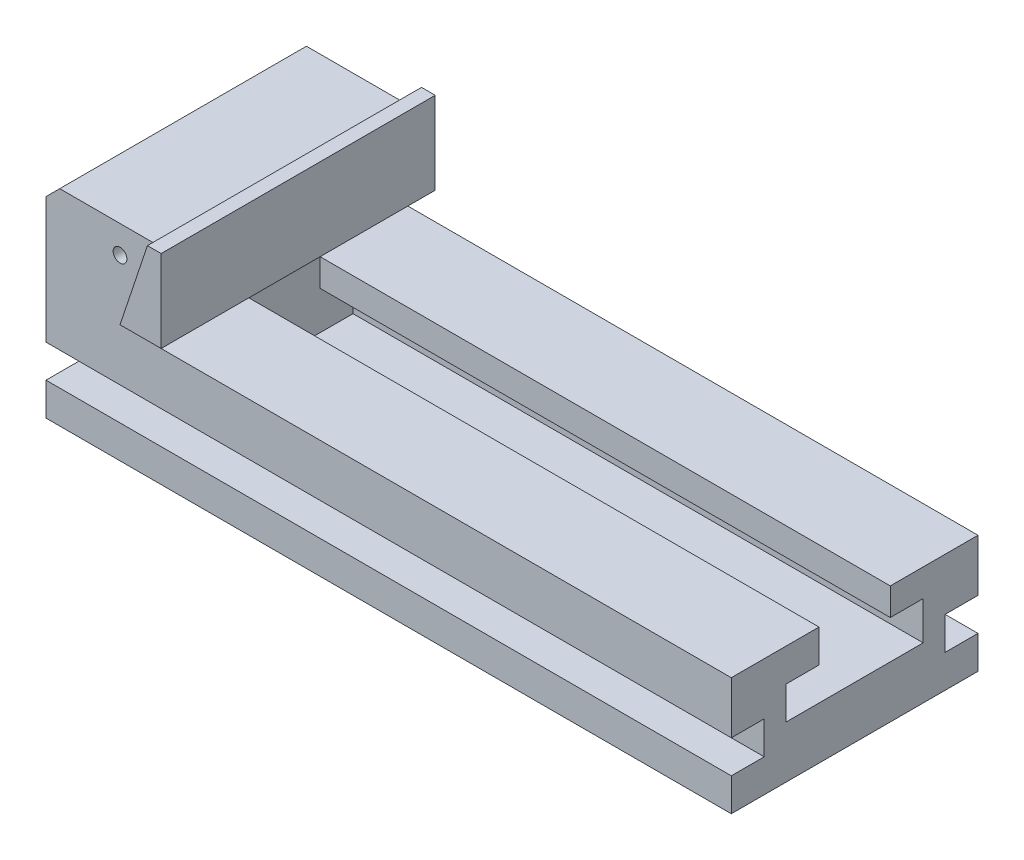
ISO-10303-21;
HEADER;
FILE_DESCRIPTION(('STEP AP214'),'2;1');
FILE_NAME('part.step','',(''),(''),'','','');
FILE_SCHEMA(('AUTOMOTIVE_DESIGN { 1 0 10303 214 1 1 1 1 }'));
ENDSEC;
DATA;
#1=APPLICATION_CONTEXT('core data for automotive mechanical design processes');
#2=APPLICATION_PROTOCOL_DEFINITION('international standard','automotive_design',2000,#1);
#3=PRODUCT_CONTEXT('',#1,'mechanical');
#4=PRODUCT('Part','Part','',(#3));
#5=PRODUCT_RELATED_PRODUCT_CATEGORY('part','',(#4));
#6=PRODUCT_DEFINITION_FORMATION('','',#4);
#7=PRODUCT_DEFINITION_CONTEXT('part definition',#1,'design');
#8=PRODUCT_DEFINITION('design','',#6,#7);
#9=PRODUCT_DEFINITION_SHAPE('','',#8);
#10=(LENGTH_UNIT() NAMED_UNIT(*) SI_UNIT(.MILLI.,.METRE.));
#11=(NAMED_UNIT(*) PLANE_ANGLE_UNIT() SI_UNIT($,.RADIAN.));
#12=(NAMED_UNIT(*) SI_UNIT($,.STERADIAN.) SOLID_ANGLE_UNIT());
#13=UNCERTAINTY_MEASURE_WITH_UNIT(LENGTH_MEASURE(1.E-05),#10,'distance_accuracy_value','');
#14=(GEOMETRIC_REPRESENTATION_CONTEXT(3) GLOBAL_UNCERTAINTY_ASSIGNED_CONTEXT((#13)) GLOBAL_UNIT_ASSIGNED_CONTEXT((#10,
#11,#12)) REPRESENTATION_CONTEXT('',''));
#15=CARTESIAN_POINT('',(0.,0.,0.));
#16=DIRECTION('',(0.,0.,1.));
#17=DIRECTION('',(1.,0.,0.));
#18=AXIS2_PLACEMENT_3D('',#15,#16,#17);
#19=CARTESIAN_POINT('',(0.,75.,0.));
#20=DIRECTION('',(0.,0.,1.));
#21=DIRECTION('',(1.,0.,0.));
#22=AXIS2_PLACEMENT_3D('',#19,#20,#21);
#23=PLANE('',#22);
#24=DIRECTION('',(0.316227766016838,0.948683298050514,0.));
#25=VECTOR('',#24,1.);
#26=CARTESIAN_POINT('',(-188.1,137.7,0.));
#27=LINE('',#26,#25);
#28=CARTESIAN_POINT('',(-218.,48.,0.));
#29=VERTEX_POINT('',#28);
#30=CARTESIAN_POINT('',(-209.,75.,0.));
#31=VERTEX_POINT('',#30);
#32=EDGE_CURVE('E45',#29,#31,#27,.T.);
#33=ORIENTED_EDGE('',*,*,#32,.F.);
#34=DIRECTION('',(-1.,0.,0.));
#35=VECTOR('',#34,1.);
#36=CARTESIAN_POINT('',(0.,48.,0.));
#37=LINE('',#36,#35);
#38=CARTESIAN_POINT('',(-208.,48.,0.));
#39=VERTEX_POINT('',#38);
#40=EDGE_CURVE('E272',#39,#29,#37,.T.);
#41=ORIENTED_EDGE('',*,*,#40,.F.);
#42=DIRECTION('',(0.,1.,0.));
#43=VECTOR('',#42,1.);
#44=CARTESIAN_POINT('',(-208.,48.,0.));
#45=LINE('',#44,#43);
#46=CARTESIAN_POINT('',(-208.,43.,0.));
#47=VERTEX_POINT('',#46);
#48=EDGE_CURVE('E391',#47,#39,#45,.T.);
#49=ORIENTED_EDGE('',*,*,#48,.F.);
#50=DIRECTION('',(-1.,0.,0.));
#51=VECTOR('',#50,1.);
#52=CARTESIAN_POINT('',(-208.,43.,0.));
#53=LINE('',#52,#51);
#54=CARTESIAN_POINT('',(0.,43.,0.));
#55=VERTEX_POINT('',#54);
#56=EDGE_CURVE('E388',#55,#47,#53,.T.);
#57=ORIENTED_EDGE('',*,*,#56,.F.);
#58=DIRECTION('',(0.,1.,0.));
#59=VECTOR('',#58,1.);
#60=CARTESIAN_POINT('',(0.,43.,0.));
#61=LINE('',#60,#59);
#62=CARTESIAN_POINT('',(0.,24.,0.));
#63=VERTEX_POINT('',#62);
#64=EDGE_CURVE('E384',#63,#55,#61,.T.);
#65=ORIENTED_EDGE('',*,*,#64,.F.);
#66=DIRECTION('',(1.,0.,0.));
#67=VECTOR('',#66,1.);
#68=CARTESIAN_POINT('',(-250.,24.,0.));
#69=LINE('',#68,#67);
#70=CARTESIAN_POINT('',(-250.,24.,0.));
#71=VERTEX_POINT('',#70);
#72=EDGE_CURVE('E298',#71,#63,#69,.T.);
#73=ORIENTED_EDGE('',*,*,#72,.F.);
#74=DIRECTION('',(0.,-1.,0.));
#75=VECTOR('',#74,1.);
#76=CARTESIAN_POINT('',(-250.,0.,0.));
#77=LINE('',#76,#75);
#78=CARTESIAN_POINT('',(-250.,69.9999999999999,0.));
#79=VERTEX_POINT('',#78);
#80=EDGE_CURVE('E397',#79,#71,#77,.T.);
#81=ORIENTED_EDGE('',*,*,#80,.F.);
#82=DIRECTION('',(-0.707106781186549,-0.707106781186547,0.));
#83=VECTOR('',#82,1.);
#84=CARTESIAN_POINT('',(-250.,70.,0.));
#85=LINE('',#84,#83);
#86=CARTESIAN_POINT('',(-245.,75.,0.));
#87=VERTEX_POINT('',#86);
#88=EDGE_CURVE('E440',#79,#87,#85,.F.);
#89=ORIENTED_EDGE('',*,*,#88,.T.);
#90=DIRECTION('',(-1.,0.,0.));
#91=VECTOR('',#90,1.);
#92=CARTESIAN_POINT('',(-250.,75.,0.));
#93=LINE('',#92,#91);
#94=EDGE_CURVE('E394',#31,#87,#93,.T.);
#95=ORIENTED_EDGE('',*,*,#94,.F.);
#96=EDGE_LOOP('',(#33,#41,#49,#57,#65,#73,#81,#89,#95));
#97=FACE_BOUND('',#96,.T.);
#98=ADVANCED_FACE('F30',(#97),#23,.F.);
#99=CARTESIAN_POINT('',(-250.,75.,90.));
#100=DIRECTION('',(0.,-1.,0.));
#101=DIRECTION('',(0.,0.,-1.));
#102=AXIS2_PLACEMENT_3D('',#99,#100,#101);
#103=PLANE('',#102);
#104=DIRECTION('',(0.,0.,1.));
#105=VECTOR('',#104,1.);
#106=CARTESIAN_POINT('',(-209.,75.,90.));
#107=LINE('',#106,#105);
#108=CARTESIAN_POINT('',(-209.,75.,90.));
#109=VERTEX_POINT('',#108);
#110=EDGE_CURVE('E53',#31,#109,#107,.T.);
#111=ORIENTED_EDGE('',*,*,#110,.F.);
#112=ORIENTED_EDGE('',*,*,#94,.T.);
#113=DIRECTION('',(0.,0.,1.));
#114=VECTOR('',#113,1.);
#115=CARTESIAN_POINT('',(-245.,75.,90.));
#116=LINE('',#115,#114);
#117=CARTESIAN_POINT('',(-245.,75.,90.));
#118=VERTEX_POINT('',#117);
#119=EDGE_CURVE('E443',#87,#118,#116,.T.);
#120=ORIENTED_EDGE('',*,*,#119,.T.);
#121=DIRECTION('',(-1.,0.,0.));
#122=VECTOR('',#121,1.);
#123=CARTESIAN_POINT('',(-250.,75.,90.));
#124=LINE('',#123,#122);
#125=EDGE_CURVE('E410',#109,#118,#124,.T.);
#126=ORIENTED_EDGE('',*,*,#125,.F.);
#127=EDGE_LOOP('',(#111,#112,#120,#126));
#128=FACE_BOUND('',#127,.T.);
#129=ADVANCED_FACE('F506',(#128),#103,.F.);
#130=CARTESIAN_POINT('',(0.,75.,90.));
#131=DIRECTION('',(0.,0.,1.));
#132=DIRECTION('',(1.,0.,0.));
#133=AXIS2_PLACEMENT_3D('',#130,#131,#132);
#134=PLANE('',#133);
#135=CARTESIAN_POINT('',(-223.,65.,90.));
#136=DIRECTION('',(0.,0.,1.));
#137=DIRECTION('',(1.,0.,0.));
#138=AXIS2_PLACEMENT_3D('',#135,#136,#137);
#139=CIRCLE('',#138,2.5);
#140=CARTESIAN_POINT('',(-220.5,65.,90.));
#141=VERTEX_POINT('',#140);
#142=EDGE_CURVE('E239',#141,#141,#139,.T.);
#143=ORIENTED_EDGE('',*,*,#142,.F.);
#144=EDGE_LOOP('',(#143));
#145=FACE_BOUND('',#144,.T.);
#146=DIRECTION('',(-1.,0.,0.));
#147=VECTOR('',#146,1.);
#148=CARTESIAN_POINT('',(0.,48.,90.));
#149=LINE('',#148,#147);
#150=CARTESIAN_POINT('',(-208.,48.,90.));
#151=VERTEX_POINT('',#150);
#152=CARTESIAN_POINT('',(-218.,48.,90.));
#153=VERTEX_POINT('',#152);
#154=EDGE_CURVE('E38',#151,#153,#149,.T.);
#155=ORIENTED_EDGE('',*,*,#154,.T.);
#156=DIRECTION('',(0.316227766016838,0.948683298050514,0.));
#157=VECTOR('',#156,1.);
#158=CARTESIAN_POINT('',(-188.1,137.7,90.));
#159=LINE('',#158,#157);
#160=EDGE_CURVE('E11',#153,#109,#159,.T.);
#161=ORIENTED_EDGE('',*,*,#160,.T.);
#162=ORIENTED_EDGE('',*,*,#125,.T.);
#163=DIRECTION('',(0.707106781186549,0.707106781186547,0.));
#164=VECTOR('',#163,1.);
#165=CARTESIAN_POINT('',(-122.5,197.5,90.));
#166=LINE('',#165,#164);
#167=CARTESIAN_POINT('',(-250.,69.9999999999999,90.));
#168=VERTEX_POINT('',#167);
#169=EDGE_CURVE('E446',#118,#168,#166,.F.);
#170=ORIENTED_EDGE('',*,*,#169,.T.);
#171=DIRECTION('',(0.,-1.,0.));
#172=VECTOR('',#171,1.);
#173=CARTESIAN_POINT('',(-250.,0.,90.));
#174=LINE('',#173,#172);
#175=CARTESIAN_POINT('',(-250.,24.,90.));
#176=VERTEX_POINT('',#175);
#177=EDGE_CURVE('E413',#168,#176,#174,.T.);
#178=ORIENTED_EDGE('',*,*,#177,.T.);
#179=DIRECTION('',(1.,0.,0.));
#180=VECTOR('',#179,1.);
#181=CARTESIAN_POINT('',(-250.,24.,90.));
#182=LINE('',#181,#180);
#183=CARTESIAN_POINT('',(0.,24.,90.));
#184=VERTEX_POINT('',#183);
#185=EDGE_CURVE('E322',#176,#184,#182,.T.);
#186=ORIENTED_EDGE('',*,*,#185,.T.);
#187=DIRECTION('',(0.,1.,0.));
#188=VECTOR('',#187,1.);
#189=CARTESIAN_POINT('',(0.,43.,90.));
#190=LINE('',#189,#188);
#191=CARTESIAN_POINT('',(0.,43.,90.));
#192=VERTEX_POINT('',#191);
#193=EDGE_CURVE('E402',#184,#192,#190,.T.);
#194=ORIENTED_EDGE('',*,*,#193,.T.);
#195=DIRECTION('',(-1.,0.,0.));
#196=VECTOR('',#195,1.);
#197=CARTESIAN_POINT('',(-208.,43.,90.));
#198=LINE('',#197,#196);
#199=CARTESIAN_POINT('',(-208.,43.,90.));
#200=VERTEX_POINT('',#199);
#201=EDGE_CURVE('E406',#192,#200,#198,.T.);
#202=ORIENTED_EDGE('',*,*,#201,.T.);
#203=DIRECTION('',(0.,1.,0.));
#204=VECTOR('',#203,1.);
#205=CARTESIAN_POINT('',(-208.,48.,90.));
#206=LINE('',#205,#204);
#207=EDGE_CURVE('E408',#200,#151,#206,.T.);
#208=ORIENTED_EDGE('',*,*,#207,.T.);
#209=EDGE_LOOP('',(#155,#161,#162,#170,#178,#186,#194,#202,#208));
#210=FACE_BOUND('',#209,.T.);
#211=ADVANCED_FACE('F450',(#145,#210),#134,.T.);
#212=CARTESIAN_POINT('',(0.,43.,90.));
#213=DIRECTION('',(-1.,0.,0.));
#214=DIRECTION('',(0.,-1.,0.));
#215=AXIS2_PLACEMENT_3D('',#212,#213,#214);
#216=PLANE('',#215);
#217=DIRECTION('',(0.,0.,1.));
#218=VECTOR('',#217,1.);
#219=CARTESIAN_POINT('',(0.,12.,12.));
#220=LINE('',#219,#218);
#221=CARTESIAN_POINT('',(0.,12.,0.));
#222=VERTEX_POINT('',#221);
#223=CARTESIAN_POINT('',(0.,12.,12.));
#224=VERTEX_POINT('',#223);
#225=EDGE_CURVE('E276',#222,#224,#220,.T.);
#226=ORIENTED_EDGE('',*,*,#225,.T.);
#227=DIRECTION('',(0.,1.,0.));
#228=VECTOR('',#227,1.);
#229=CARTESIAN_POINT('',(0.,24.,12.));
#230=LINE('',#229,#228);
#231=CARTESIAN_POINT('',(0.,24.,12.));
#232=VERTEX_POINT('',#231);
#233=EDGE_CURVE('E282',#224,#232,#230,.T.);
#234=ORIENTED_EDGE('',*,*,#233,.T.);
#235=DIRECTION('',(0.,0.,-1.));
#236=VECTOR('',#235,1.);
#237=CARTESIAN_POINT('',(0.,24.,0.));
#238=LINE('',#237,#236);
#239=EDGE_CURVE('E279',#232,#63,#238,.T.);
#240=ORIENTED_EDGE('',*,*,#239,.T.);
#241=ORIENTED_EDGE('',*,*,#64,.T.);
#242=DIRECTION('',(0.,0.,-1.));
#243=VECTOR('',#242,1.);
#244=CARTESIAN_POINT('',(0.,43.,90.));
#245=LINE('',#244,#243);
#246=CARTESIAN_POINT('',(0.,43.,32.));
#247=VERTEX_POINT('',#246);
#248=EDGE_CURVE('E433',#247,#55,#245,.T.);
#249=ORIENTED_EDGE('',*,*,#248,.F.);
#250=DIRECTION('',(0.,1.,0.));
#251=VECTOR('',#250,1.);
#252=CARTESIAN_POINT('',(0.,33.,32.));
#253=LINE('',#252,#251);
#254=CARTESIAN_POINT('',(0.,33.,32.));
#255=VERTEX_POINT('',#254);
#256=EDGE_CURVE('E328',#255,#247,#253,.T.);
#257=ORIENTED_EDGE('',*,*,#256,.F.);
#258=DIRECTION('',(0.,0.,1.));
#259=VECTOR('',#258,1.);
#260=CARTESIAN_POINT('',(0.,33.,20.));
#261=LINE('',#260,#259);
#262=CARTESIAN_POINT('',(0.,33.,20.));
#263=VERTEX_POINT('',#262);
#264=EDGE_CURVE('E331',#263,#255,#261,.T.);
#265=ORIENTED_EDGE('',*,*,#264,.F.);
#266=DIRECTION('',(0.,1.,0.));
#267=VECTOR('',#266,1.);
#268=CARTESIAN_POINT('',(0.,19.,20.));
#269=LINE('',#268,#267);
#270=CARTESIAN_POINT('',(0.,19.,20.));
#271=VERTEX_POINT('',#270);
#272=EDGE_CURVE('E334',#271,#263,#269,.T.);
#273=ORIENTED_EDGE('',*,*,#272,.F.);
#274=DIRECTION('',(0.,0.,-1.));
#275=VECTOR('',#274,1.);
#276=CARTESIAN_POINT('',(0.,19.,70.));
#277=LINE('',#276,#275);
#278=CARTESIAN_POINT('',(0.,19.,70.));
#279=VERTEX_POINT('',#278);
#280=EDGE_CURVE('E337',#279,#271,#277,.T.);
#281=ORIENTED_EDGE('',*,*,#280,.F.);
#282=DIRECTION('',(0.,-1.,0.));
#283=VECTOR('',#282,1.);
#284=CARTESIAN_POINT('',(0.,31.,70.));
#285=LINE('',#284,#283);
#286=CARTESIAN_POINT('',(0.,31.,70.));
#287=VERTEX_POINT('',#286);
#288=EDGE_CURVE('E340',#287,#279,#285,.T.);
#289=ORIENTED_EDGE('',*,*,#288,.F.);
#290=DIRECTION('',(0.,0.,1.));
#291=VECTOR('',#290,1.);
#292=CARTESIAN_POINT('',(0.,31.,58.));
#293=LINE('',#292,#291);
#294=CARTESIAN_POINT('',(0.,31.,58.));
#295=VERTEX_POINT('',#294);
#296=EDGE_CURVE('E343',#295,#287,#293,.T.);
#297=ORIENTED_EDGE('',*,*,#296,.F.);
#298=DIRECTION('',(0.,-1.,0.));
#299=VECTOR('',#298,1.);
#300=CARTESIAN_POINT('',(0.,43.,58.));
#301=LINE('',#300,#299);
#302=CARTESIAN_POINT('',(0.,43.,58.));
#303=VERTEX_POINT('',#302);
#304=EDGE_CURVE('E321',#303,#295,#301,.T.);
#305=ORIENTED_EDGE('',*,*,#304,.F.);
#306=EDGE_CURVE('E434',#192,#303,#245,.T.);
#307=ORIENTED_EDGE('',*,*,#306,.F.);
#308=ORIENTED_EDGE('',*,*,#193,.F.);
#309=DIRECTION('',(0.,0.,1.));
#310=VECTOR('',#309,1.);
#311=CARTESIAN_POINT('',(0.,24.,90.));
#312=LINE('',#311,#310);
#313=CARTESIAN_POINT('',(0.,24.,78.));
#314=VERTEX_POINT('',#313);
#315=EDGE_CURVE('E307',#314,#184,#312,.T.);
#316=ORIENTED_EDGE('',*,*,#315,.F.);
#317=DIRECTION('',(0.,1.,0.));
#318=VECTOR('',#317,1.);
#319=CARTESIAN_POINT('',(0.,24.,78.));
#320=LINE('',#319,#318);
#321=CARTESIAN_POINT('',(0.,12.,78.));
#322=VERTEX_POINT('',#321);
#323=EDGE_CURVE('E304',#322,#314,#320,.T.);
#324=ORIENTED_EDGE('',*,*,#323,.F.);
#325=DIRECTION('',(0.,0.,-1.));
#326=VECTOR('',#325,1.);
#327=CARTESIAN_POINT('',(0.,12.,78.));
#328=LINE('',#327,#326);
#329=CARTESIAN_POINT('',(0.,12.,90.));
#330=VERTEX_POINT('',#329);
#331=EDGE_CURVE('E295',#330,#322,#328,.T.);
#332=ORIENTED_EDGE('',*,*,#331,.F.);
#333=CARTESIAN_POINT('',(0.,0.,90.));
#334=VERTEX_POINT('',#333);
#335=EDGE_CURVE('E403',#334,#330,#190,.T.);
#336=ORIENTED_EDGE('',*,*,#335,.F.);
#337=DIRECTION('',(0.,0.,-1.));
#338=VECTOR('',#337,1.);
#339=CARTESIAN_POINT('',(0.,0.,90.));
#340=LINE('',#339,#338);
#341=CARTESIAN_POINT('',(0.,0.,0.));
#342=VERTEX_POINT('',#341);
#343=EDGE_CURVE('E418',#334,#342,#340,.T.);
#344=ORIENTED_EDGE('',*,*,#343,.T.);
#345=EDGE_CURVE('E385',#342,#222,#61,.T.);
#346=ORIENTED_EDGE('',*,*,#345,.T.);
#347=EDGE_LOOP('',(#226,#234,#240,#241,#249,#257,#265,#273,#281,#289,#297,#305,#307,#308,#316,
#324,#332,#336,#344,#346));
#348=FACE_BOUND('',#347,.T.);
#349=ADVANCED_FACE('F32',(#348),#216,.F.);
#350=CARTESIAN_POINT('',(-250.,0.,90.));
#351=DIRECTION('',(1.,0.,0.));
#352=DIRECTION('',(0.,0.,-1.));
#353=AXIS2_PLACEMENT_3D('',#350,#351,#352);
#354=PLANE('',#353);
#355=DIRECTION('',(0.,0.,1.));
#356=VECTOR('',#355,1.);
#357=CARTESIAN_POINT('',(-250.,12.,12.));
#358=LINE('',#357,#356);
#359=CARTESIAN_POINT('',(-250.,12.,0.));
#360=VERTEX_POINT('',#359);
#361=CARTESIAN_POINT('',(-250.,12.,12.));
#362=VERTEX_POINT('',#361);
#363=EDGE_CURVE('E285',#360,#362,#358,.T.);
#364=ORIENTED_EDGE('',*,*,#363,.F.);
#365=CARTESIAN_POINT('',(-250.,0.,0.));
#366=VERTEX_POINT('',#365);
#367=EDGE_CURVE('E396',#360,#366,#77,.T.);
#368=ORIENTED_EDGE('',*,*,#367,.T.);
#369=DIRECTION('',(0.,0.,-1.));
#370=VECTOR('',#369,1.);
#371=CARTESIAN_POINT('',(-250.,0.,90.));
#372=LINE('',#371,#370);
#373=CARTESIAN_POINT('',(-250.,0.,90.));
#374=VERTEX_POINT('',#373);
#375=EDGE_CURVE('E421',#374,#366,#372,.T.);
#376=ORIENTED_EDGE('',*,*,#375,.F.);
#377=CARTESIAN_POINT('',(-250.,12.,90.));
#378=VERTEX_POINT('',#377);
#379=EDGE_CURVE('E412',#378,#374,#174,.T.);
#380=ORIENTED_EDGE('',*,*,#379,.F.);
#381=DIRECTION('',(0.,0.,-1.));
#382=VECTOR('',#381,1.);
#383=CARTESIAN_POINT('',(-250.,12.,78.));
#384=LINE('',#383,#382);
#385=CARTESIAN_POINT('',(-250.,12.,78.));
#386=VERTEX_POINT('',#385);
#387=EDGE_CURVE('E309',#378,#386,#384,.T.);
#388=ORIENTED_EDGE('',*,*,#387,.T.);
#389=DIRECTION('',(0.,1.,0.));
#390=VECTOR('',#389,1.);
#391=CARTESIAN_POINT('',(-250.,24.,78.));
#392=LINE('',#391,#390);
#393=CARTESIAN_POINT('',(-250.,24.,78.));
#394=VERTEX_POINT('',#393);
#395=EDGE_CURVE('E312',#386,#394,#392,.T.);
#396=ORIENTED_EDGE('',*,*,#395,.T.);
#397=DIRECTION('',(0.,0.,1.));
#398=VECTOR('',#397,1.);
#399=CARTESIAN_POINT('',(-250.,24.,90.));
#400=LINE('',#399,#398);
#401=EDGE_CURVE('E315',#394,#176,#400,.T.);
#402=ORIENTED_EDGE('',*,*,#401,.T.);
#403=ORIENTED_EDGE('',*,*,#177,.F.);
#404=DIRECTION('',(0.,0.,-1.));
#405=VECTOR('',#404,1.);
#406=CARTESIAN_POINT('',(-250.,70.,90.));
#407=LINE('',#406,#405);
#408=EDGE_CURVE('E437',#168,#79,#407,.T.);
#409=ORIENTED_EDGE('',*,*,#408,.T.);
#410=ORIENTED_EDGE('',*,*,#80,.T.);
#411=DIRECTION('',(0.,0.,-1.));
#412=VECTOR('',#411,1.);
#413=CARTESIAN_POINT('',(-250.,24.,0.));
#414=LINE('',#413,#412);
#415=CARTESIAN_POINT('',(-250.,24.,12.));
#416=VERTEX_POINT('',#415);
#417=EDGE_CURVE('E287',#416,#71,#414,.T.);
#418=ORIENTED_EDGE('',*,*,#417,.F.);
#419=DIRECTION('',(0.,1.,0.));
#420=VECTOR('',#419,1.);
#421=CARTESIAN_POINT('',(-250.,24.,12.));
#422=LINE('',#421,#420);
#423=EDGE_CURVE('E289',#362,#416,#422,.T.);
#424=ORIENTED_EDGE('',*,*,#423,.F.);
#425=EDGE_LOOP('',(#364,#368,#376,#380,#388,#396,#402,#403,#409,#410,#418,#424));
#426=FACE_BOUND('',#425,.T.);
#427=ADVANCED_FACE('F499',(#426),#354,.F.);
#428=DIRECTION('',(1.,0.,0.));
#429=VECTOR('',#428,1.);
#430=CARTESIAN_POINT('',(-250.,12.,0.));
#431=LINE('',#430,#429);
#432=EDGE_CURVE('E291',#360,#222,#431,.T.);
#433=ORIENTED_EDGE('',*,*,#432,.T.);
#434=ORIENTED_EDGE('',*,*,#345,.F.);
#435=DIRECTION('',(1.,0.,0.));
#436=VECTOR('',#435,1.);
#437=CARTESIAN_POINT('',(0.,0.,0.));
#438=LINE('',#437,#436);
#439=EDGE_CURVE('E400',#366,#342,#438,.T.);
#440=ORIENTED_EDGE('',*,*,#439,.F.);
#441=ORIENTED_EDGE('',*,*,#367,.F.);
#442=EDGE_LOOP('',(#433,#434,#440,#441));
#443=FACE_BOUND('',#442,.T.);
#444=ADVANCED_FACE('F558',(#443),#23,.F.);
#445=DIRECTION('',(1.,0.,0.));
#446=VECTOR('',#445,1.);
#447=CARTESIAN_POINT('',(-250.,12.,90.));
#448=LINE('',#447,#446);
#449=EDGE_CURVE('E319',#378,#330,#448,.T.);
#450=ORIENTED_EDGE('',*,*,#449,.F.);
#451=ORIENTED_EDGE('',*,*,#379,.T.);
#452=DIRECTION('',(1.,0.,0.));
#453=VECTOR('',#452,1.);
#454=CARTESIAN_POINT('',(0.,0.,90.));
#455=LINE('',#454,#453);
#456=EDGE_CURVE('E416',#374,#334,#455,.T.);
#457=ORIENTED_EDGE('',*,*,#456,.T.);
#458=ORIENTED_EDGE('',*,*,#335,.T.);
#459=EDGE_LOOP('',(#450,#451,#457,#458));
#460=FACE_BOUND('',#459,.T.);
#461=ADVANCED_FACE('F566',(#460),#134,.T.);
#462=CARTESIAN_POINT('',(-208.,43.,90.));
#463=DIRECTION('',(0.,-1.,0.));
#464=DIRECTION('',(1.,0.,0.));
#465=AXIS2_PLACEMENT_3D('',#462,#463,#464);
#466=PLANE('',#465);
#467=ORIENTED_EDGE('',*,*,#306,.T.);
#468=DIRECTION('',(1.,0.,0.));
#469=VECTOR('',#468,1.);
#470=CARTESIAN_POINT('',(-263.461698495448,43.,58.));
#471=LINE('',#470,#469);
#472=CARTESIAN_POINT('',(-208.,43.,58.));
#473=VERTEX_POINT('',#472);
#474=EDGE_CURVE('E376',#473,#303,#471,.T.);
#475=ORIENTED_EDGE('',*,*,#474,.F.);
#476=DIRECTION('',(0.,0.,-1.));
#477=VECTOR('',#476,1.);
#478=CARTESIAN_POINT('',(-208.,43.,90.));
#479=LINE('',#478,#477);
#480=EDGE_CURVE('E430',#200,#473,#479,.T.);
#481=ORIENTED_EDGE('',*,*,#480,.F.);
#482=ORIENTED_EDGE('',*,*,#201,.F.);
#483=EDGE_LOOP('',(#467,#475,#481,#482));
#484=FACE_BOUND('',#483,.T.);
#485=ADVANCED_FACE('F520',(#484),#466,.F.);
#486=CARTESIAN_POINT('',(-208.,43.,32.));
#487=VERTEX_POINT('',#486);
#488=EDGE_CURVE('E429',#487,#47,#479,.T.);
#489=ORIENTED_EDGE('',*,*,#488,.F.);
#490=DIRECTION('',(1.,0.,0.));
#491=VECTOR('',#490,1.);
#492=CARTESIAN_POINT('',(-263.461698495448,43.,32.));
#493=LINE('',#492,#491);
#494=EDGE_CURVE('E353',#487,#247,#493,.T.);
#495=ORIENTED_EDGE('',*,*,#494,.T.);
#496=ORIENTED_EDGE('',*,*,#248,.T.);
#497=ORIENTED_EDGE('',*,*,#56,.T.);
#498=EDGE_LOOP('',(#489,#495,#496,#497));
#499=FACE_BOUND('',#498,.T.);
#500=ADVANCED_FACE('F484',(#499),#466,.F.);
#501=CARTESIAN_POINT('',(-208.,48.,90.));
#502=DIRECTION('',(-1.,0.,0.));
#503=DIRECTION('',(0.,0.,1.));
#504=AXIS2_PLACEMENT_3D('',#501,#502,#503);
#505=PLANE('',#504);
#506=ORIENTED_EDGE('',*,*,#48,.T.);
#507=DIRECTION('',(0.,0.,-1.));
#508=VECTOR('',#507,1.);
#509=CARTESIAN_POINT('',(-208.,48.,90.));
#510=LINE('',#509,#508);
#511=EDGE_CURVE('E426',#151,#39,#510,.T.);
#512=ORIENTED_EDGE('',*,*,#511,.F.);
#513=ORIENTED_EDGE('',*,*,#207,.F.);
#514=ORIENTED_EDGE('',*,*,#480,.T.);
#515=DIRECTION('',(0.,-1.,0.));
#516=VECTOR('',#515,1.);
#517=CARTESIAN_POINT('',(-208.,43.,58.));
#518=LINE('',#517,#516);
#519=CARTESIAN_POINT('',(-208.,31.,58.));
#520=VERTEX_POINT('',#519);
#521=EDGE_CURVE('E330',#473,#520,#518,.T.);
#522=ORIENTED_EDGE('',*,*,#521,.T.);
#523=DIRECTION('',(0.,0.,1.));
#524=VECTOR('',#523,1.);
#525=CARTESIAN_POINT('',(-208.,31.,58.));
#526=LINE('',#525,#524);
#527=CARTESIAN_POINT('',(-208.,30.9999999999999,70.));
#528=VERTEX_POINT('',#527);
#529=EDGE_CURVE('E371',#520,#528,#526,.T.);
#530=ORIENTED_EDGE('',*,*,#529,.T.);
#531=DIRECTION('',(0.,-1.,0.));
#532=VECTOR('',#531,1.);
#533=CARTESIAN_POINT('',(-208.,30.9999999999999,70.));
#534=LINE('',#533,#532);
#535=CARTESIAN_POINT('',(-208.,18.9999999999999,70.));
#536=VERTEX_POINT('',#535);
#537=EDGE_CURVE('E367',#528,#536,#534,.T.);
#538=ORIENTED_EDGE('',*,*,#537,.T.);
#539=DIRECTION('',(0.,0.,-1.));
#540=VECTOR('',#539,1.);
#541=CARTESIAN_POINT('',(-208.,18.9999999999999,70.));
#542=LINE('',#541,#540);
#543=CARTESIAN_POINT('',(-208.,18.9999999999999,20.));
#544=VERTEX_POINT('',#543);
#545=EDGE_CURVE('E363',#536,#544,#542,.T.);
#546=ORIENTED_EDGE('',*,*,#545,.T.);
#547=DIRECTION('',(0.,1.,0.));
#548=VECTOR('',#547,1.);
#549=CARTESIAN_POINT('',(-208.,18.9999999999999,20.));
#550=LINE('',#549,#548);
#551=CARTESIAN_POINT('',(-208.,33.,20.));
#552=VERTEX_POINT('',#551);
#553=EDGE_CURVE('E359',#544,#552,#550,.T.);
#554=ORIENTED_EDGE('',*,*,#553,.T.);
#555=DIRECTION('',(0.,0.,1.));
#556=VECTOR('',#555,1.);
#557=CARTESIAN_POINT('',(-208.,33.,20.));
#558=LINE('',#557,#556);
#559=CARTESIAN_POINT('',(-208.,33.,32.));
#560=VERTEX_POINT('',#559);
#561=EDGE_CURVE('E355',#552,#560,#558,.T.);
#562=ORIENTED_EDGE('',*,*,#561,.T.);
#563=DIRECTION('',(0.,1.,0.));
#564=VECTOR('',#563,1.);
#565=CARTESIAN_POINT('',(-208.,33.,32.));
#566=LINE('',#565,#564);
#567=EDGE_CURVE('E351',#560,#487,#566,.T.);
#568=ORIENTED_EDGE('',*,*,#567,.T.);
#569=ORIENTED_EDGE('',*,*,#488,.T.);
#570=EDGE_LOOP('',(#506,#512,#513,#514,#522,#530,#538,#546,#554,#562,#568,#569));
#571=FACE_BOUND('',#570,.T.);
#572=ADVANCED_FACE('F479',(#571),#505,.F.);
#573=CARTESIAN_POINT('',(-203.,48.,90.));
#574=DIRECTION('',(0.,1.,0.));
#575=DIRECTION('',(-1.,0.,0.));
#576=AXIS2_PLACEMENT_3D('',#573,#574,#575);
#577=PLANE('',#576);
#578=ORIENTED_EDGE('',*,*,#511,.T.);
#579=ORIENTED_EDGE('',*,*,#40,.T.);
#580=DIRECTION('',(0.,0.,-1.));
#581=VECTOR('',#580,1.);
#582=CARTESIAN_POINT('',(-218.,48.,95.));
#583=LINE('',#582,#581);
#584=CARTESIAN_POINT('',(-218.,48.,-5.00000000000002));
#585=VERTEX_POINT('',#584);
#586=EDGE_CURVE('E266',#29,#585,#583,.T.);
#587=ORIENTED_EDGE('',*,*,#586,.T.);
#588=DIRECTION('',(1.,0.,0.));
#589=VECTOR('',#588,1.);
#590=CARTESIAN_POINT('',(-203.,48.,-5.00000000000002));
#591=LINE('',#590,#589);
#592=CARTESIAN_POINT('',(-203.,48.,-5.00000000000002));
#593=VERTEX_POINT('',#592);
#594=EDGE_CURVE('E248',#585,#593,#591,.T.);
#595=ORIENTED_EDGE('',*,*,#594,.T.);
#596=DIRECTION('',(0.,0.,-1.));
#597=VECTOR('',#596,1.);
#598=CARTESIAN_POINT('',(-203.,48.,90.));
#599=LINE('',#598,#597);
#600=CARTESIAN_POINT('',(-203.,48.,95.));
#601=VERTEX_POINT('',#600);
#602=EDGE_CURVE('E424',#601,#593,#599,.T.);
#603=ORIENTED_EDGE('',*,*,#602,.F.);
#604=DIRECTION('',(1.,0.,0.));
#605=VECTOR('',#604,1.);
#606=CARTESIAN_POINT('',(-203.,48.,95.));
#607=LINE('',#606,#605);
#608=CARTESIAN_POINT('',(-218.,48.,95.));
#609=VERTEX_POINT('',#608);
#610=EDGE_CURVE('E259',#609,#601,#607,.T.);
#611=ORIENTED_EDGE('',*,*,#610,.F.);
#612=EDGE_CURVE('E267',#609,#153,#583,.T.);
#613=ORIENTED_EDGE('',*,*,#612,.T.);
#614=ORIENTED_EDGE('',*,*,#154,.F.);
#615=EDGE_LOOP('',(#578,#579,#587,#595,#603,#611,#613,#614));
#616=FACE_BOUND('',#615,.T.);
#617=ADVANCED_FACE('F459',(#616),#577,.F.);
#618=CARTESIAN_POINT('',(-203.,75.,90.));
#619=DIRECTION('',(-1.,0.,0.));
#620=DIRECTION('',(0.,0.,1.));
#621=AXIS2_PLACEMENT_3D('',#618,#619,#620);
#622=PLANE('',#621);
#623=ORIENTED_EDGE('',*,*,#602,.T.);
#624=DIRECTION('',(0.,1.,0.));
#625=VECTOR('',#624,1.);
#626=CARTESIAN_POINT('',(-203.,78.,-5.00000000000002));
#627=LINE('',#626,#625);
#628=CARTESIAN_POINT('',(-203.,78.,-5.00000000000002));
#629=VERTEX_POINT('',#628);
#630=EDGE_CURVE('E251',#593,#629,#627,.T.);
#631=ORIENTED_EDGE('',*,*,#630,.T.);
#632=DIRECTION('',(0.,0.,-1.));
#633=VECTOR('',#632,1.);
#634=CARTESIAN_POINT('',(-203.,78.,95.));
#635=LINE('',#634,#633);
#636=CARTESIAN_POINT('',(-203.,78.,95.));
#637=VERTEX_POINT('',#636);
#638=EDGE_CURVE('E264',#637,#629,#635,.T.);
#639=ORIENTED_EDGE('',*,*,#638,.F.);
#640=DIRECTION('',(0.,1.,0.));
#641=VECTOR('',#640,1.);
#642=CARTESIAN_POINT('',(-203.,78.,95.));
#643=LINE('',#642,#641);
#644=EDGE_CURVE('E262',#601,#637,#643,.T.);
#645=ORIENTED_EDGE('',*,*,#644,.F.);
#646=EDGE_LOOP('',(#623,#631,#639,#645));
#647=FACE_BOUND('',#646,.T.);
#648=ADVANCED_FACE('F465',(#647),#622,.F.);
#649=CARTESIAN_POINT('',(0.,0.,90.));
#650=DIRECTION('',(0.,1.,0.));
#651=DIRECTION('',(-1.,0.,0.));
#652=AXIS2_PLACEMENT_3D('',#649,#650,#651);
#653=PLANE('',#652);
#654=ORIENTED_EDGE('',*,*,#439,.T.);
#655=ORIENTED_EDGE('',*,*,#343,.F.);
#656=ORIENTED_EDGE('',*,*,#456,.F.);
#657=ORIENTED_EDGE('',*,*,#375,.T.);
#658=EDGE_LOOP('',(#654,#655,#656,#657));
#659=FACE_BOUND('',#658,.T.);
#660=ADVANCED_FACE('F583',(#659),#653,.F.);
#661=CARTESIAN_POINT('',(-250.,70.,90.));
#662=DIRECTION('',(0.707106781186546,-0.707106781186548,0.));
#663=DIRECTION('',(0.707106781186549,0.707106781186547,0.));
#664=AXIS2_PLACEMENT_3D('',#661,#662,#663);
#665=PLANE('',#664);
#666=ORIENTED_EDGE('',*,*,#169,.F.);
#667=ORIENTED_EDGE('',*,*,#119,.F.);
#668=ORIENTED_EDGE('',*,*,#88,.F.);
#669=ORIENTED_EDGE('',*,*,#408,.F.);
#670=EDGE_LOOP('',(#666,#667,#668,#669));
#671=FACE_BOUND('',#670,.T.);
#672=ADVANCED_FACE('F505',(#671),#665,.F.);
#673=CARTESIAN_POINT('',(-263.461698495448,43.,58.));
#674=DIRECTION('',(0.,0.,1.));
#675=DIRECTION('',(1.,0.,0.));
#676=AXIS2_PLACEMENT_3D('',#673,#674,#675);
#677=PLANE('',#676);
#678=ORIENTED_EDGE('',*,*,#474,.T.);
#679=ORIENTED_EDGE('',*,*,#304,.T.);
#680=DIRECTION('',(1.,0.,0.));
#681=VECTOR('',#680,1.);
#682=CARTESIAN_POINT('',(-263.461698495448,31.,58.));
#683=LINE('',#682,#681);
#684=EDGE_CURVE('E350',#520,#295,#683,.T.);
#685=ORIENTED_EDGE('',*,*,#684,.F.);
#686=ORIENTED_EDGE('',*,*,#521,.F.);
#687=EDGE_LOOP('',(#678,#679,#685,#686));
#688=FACE_BOUND('',#687,.T.);
#689=ADVANCED_FACE('F524',(#688),#677,.F.);
#690=CARTESIAN_POINT('',(-263.461698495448,31.,58.));
#691=DIRECTION('',(0.,1.,0.));
#692=DIRECTION('',(0.,0.,1.));
#693=AXIS2_PLACEMENT_3D('',#690,#691,#692);
#694=PLANE('',#693);
#695=ORIENTED_EDGE('',*,*,#684,.T.);
#696=ORIENTED_EDGE('',*,*,#296,.T.);
#697=DIRECTION('',(1.,0.,0.));
#698=VECTOR('',#697,1.);
#699=CARTESIAN_POINT('',(-263.461698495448,30.9999999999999,70.));
#700=LINE('',#699,#698);
#701=EDGE_CURVE('E370',#528,#287,#700,.T.);
#702=ORIENTED_EDGE('',*,*,#701,.F.);
#703=ORIENTED_EDGE('',*,*,#529,.F.);
#704=EDGE_LOOP('',(#695,#696,#702,#703));
#705=FACE_BOUND('',#704,.T.);
#706=ADVANCED_FACE('F526',(#705),#694,.F.);
#707=CARTESIAN_POINT('',(-263.461698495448,30.9999999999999,70.));
#708=DIRECTION('',(0.,0.,1.));
#709=DIRECTION('',(1.,0.,0.));
#710=AXIS2_PLACEMENT_3D('',#707,#708,#709);
#711=PLANE('',#710);
#712=ORIENTED_EDGE('',*,*,#701,.T.);
#713=ORIENTED_EDGE('',*,*,#288,.T.);
#714=DIRECTION('',(1.,0.,0.));
#715=VECTOR('',#714,1.);
#716=CARTESIAN_POINT('',(-263.461698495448,18.9999999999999,70.));
#717=LINE('',#716,#715);
#718=EDGE_CURVE('E366',#536,#279,#717,.T.);
#719=ORIENTED_EDGE('',*,*,#718,.F.);
#720=ORIENTED_EDGE('',*,*,#537,.F.);
#721=EDGE_LOOP('',(#712,#713,#719,#720));
#722=FACE_BOUND('',#721,.T.);
#723=ADVANCED_FACE('F530',(#722),#711,.F.);
#724=CARTESIAN_POINT('',(-263.461698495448,18.9999999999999,70.));
#725=DIRECTION('',(0.,-1.,0.));
#726=DIRECTION('',(1.,0.,0.));
#727=AXIS2_PLACEMENT_3D('',#724,#725,#726);
#728=PLANE('',#727);
#729=ORIENTED_EDGE('',*,*,#718,.T.);
#730=ORIENTED_EDGE('',*,*,#280,.T.);
#731=DIRECTION('',(1.,0.,0.));
#732=VECTOR('',#731,1.);
#733=CARTESIAN_POINT('',(-263.461698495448,18.9999999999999,20.));
#734=LINE('',#733,#732);
#735=EDGE_CURVE('E362',#544,#271,#734,.T.);
#736=ORIENTED_EDGE('',*,*,#735,.F.);
#737=ORIENTED_EDGE('',*,*,#545,.F.);
#738=EDGE_LOOP('',(#729,#730,#736,#737));
#739=FACE_BOUND('',#738,.T.);
#740=ADVANCED_FACE('F535',(#739),#728,.F.);
#741=CARTESIAN_POINT('',(-263.461698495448,18.9999999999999,20.));
#742=DIRECTION('',(0.,0.,-1.));
#743=DIRECTION('',(-1.,0.,0.));
#744=AXIS2_PLACEMENT_3D('',#741,#742,#743);
#745=PLANE('',#744);
#746=ORIENTED_EDGE('',*,*,#735,.T.);
#747=ORIENTED_EDGE('',*,*,#272,.T.);
#748=DIRECTION('',(1.,0.,0.));
#749=VECTOR('',#748,1.);
#750=CARTESIAN_POINT('',(-263.461698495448,33.,20.));
#751=LINE('',#750,#749);
#752=EDGE_CURVE('E358',#552,#263,#751,.T.);
#753=ORIENTED_EDGE('',*,*,#752,.F.);
#754=ORIENTED_EDGE('',*,*,#553,.F.);
#755=EDGE_LOOP('',(#746,#747,#753,#754));
#756=FACE_BOUND('',#755,.T.);
#757=ADVANCED_FACE('F538',(#756),#745,.F.);
#758=CARTESIAN_POINT('',(-263.461698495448,33.,20.));
#759=DIRECTION('',(0.,1.,0.));
#760=DIRECTION('',(-1.,0.,0.));
#761=AXIS2_PLACEMENT_3D('',#758,#759,#760);
#762=PLANE('',#761);
#763=ORIENTED_EDGE('',*,*,#752,.T.);
#764=ORIENTED_EDGE('',*,*,#264,.T.);
#765=DIRECTION('',(1.,0.,0.));
#766=VECTOR('',#765,1.);
#767=CARTESIAN_POINT('',(-263.461698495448,33.,32.));
#768=LINE('',#767,#766);
#769=EDGE_CURVE('E354',#560,#255,#768,.T.);
#770=ORIENTED_EDGE('',*,*,#769,.F.);
#771=ORIENTED_EDGE('',*,*,#561,.F.);
#772=EDGE_LOOP('',(#763,#764,#770,#771));
#773=FACE_BOUND('',#772,.T.);
#774=ADVANCED_FACE('F542',(#773),#762,.F.);
#775=CARTESIAN_POINT('',(-263.461698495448,33.,32.));
#776=DIRECTION('',(0.,0.,-1.));
#777=DIRECTION('',(-1.,0.,0.));
#778=AXIS2_PLACEMENT_3D('',#775,#776,#777);
#779=PLANE('',#778);
#780=ORIENTED_EDGE('',*,*,#769,.T.);
#781=ORIENTED_EDGE('',*,*,#256,.T.);
#782=ORIENTED_EDGE('',*,*,#494,.F.);
#783=ORIENTED_EDGE('',*,*,#567,.F.);
#784=EDGE_LOOP('',(#780,#781,#782,#783));
#785=FACE_BOUND('',#784,.T.);
#786=ADVANCED_FACE('F545',(#785),#779,.F.);
#787=CARTESIAN_POINT('',(-250.,12.,78.));
#788=DIRECTION('',(0.,-1.,0.));
#789=DIRECTION('',(0.,0.,-1.));
#790=AXIS2_PLACEMENT_3D('',#787,#788,#789);
#791=PLANE('',#790);
#792=ORIENTED_EDGE('',*,*,#331,.T.);
#793=DIRECTION('',(1.,0.,0.));
#794=VECTOR('',#793,1.);
#795=CARTESIAN_POINT('',(-250.,12.,78.));
#796=LINE('',#795,#794);
#797=EDGE_CURVE('E318',#386,#322,#796,.T.);
#798=ORIENTED_EDGE('',*,*,#797,.F.);
#799=ORIENTED_EDGE('',*,*,#387,.F.);
#800=ORIENTED_EDGE('',*,*,#449,.T.);
#801=EDGE_LOOP('',(#792,#798,#799,#800));
#802=FACE_BOUND('',#801,.T.);
#803=ADVANCED_FACE('F547',(#802),#791,.F.);
#804=CARTESIAN_POINT('',(-250.,24.,90.));
#805=DIRECTION('',(0.,1.,0.));
#806=DIRECTION('',(-1.,0.,0.));
#807=AXIS2_PLACEMENT_3D('',#804,#805,#806);
#808=PLANE('',#807);
#809=ORIENTED_EDGE('',*,*,#315,.T.);
#810=ORIENTED_EDGE('',*,*,#185,.F.);
#811=ORIENTED_EDGE('',*,*,#401,.F.);
#812=DIRECTION('',(1.,0.,0.));
#813=VECTOR('',#812,1.);
#814=CARTESIAN_POINT('',(-250.,24.,78.));
#815=LINE('',#814,#813);
#816=EDGE_CURVE('E325',#394,#314,#815,.T.);
#817=ORIENTED_EDGE('',*,*,#816,.T.);
#818=EDGE_LOOP('',(#809,#810,#811,#817));
#819=FACE_BOUND('',#818,.T.);
#820=ADVANCED_FACE('F510',(#819),#808,.F.);
#821=CARTESIAN_POINT('',(-250.,24.,78.));
#822=DIRECTION('',(0.,0.,-1.));
#823=DIRECTION('',(-1.,0.,0.));
#824=AXIS2_PLACEMENT_3D('',#821,#822,#823);
#825=PLANE('',#824);
#826=ORIENTED_EDGE('',*,*,#323,.T.);
#827=ORIENTED_EDGE('',*,*,#816,.F.);
#828=ORIENTED_EDGE('',*,*,#395,.F.);
#829=ORIENTED_EDGE('',*,*,#797,.T.);
#830=EDGE_LOOP('',(#826,#827,#828,#829));
#831=FACE_BOUND('',#830,.T.);
#832=ADVANCED_FACE('F597',(#831),#825,.F.);
#833=CARTESIAN_POINT('',(-250.,12.,12.));
#834=DIRECTION('',(0.,1.,0.));
#835=DIRECTION('',(0.,0.,1.));
#836=AXIS2_PLACEMENT_3D('',#833,#834,#835);
#837=PLANE('',#836);
#838=ORIENTED_EDGE('',*,*,#225,.F.);
#839=ORIENTED_EDGE('',*,*,#432,.F.);
#840=ORIENTED_EDGE('',*,*,#363,.T.);
#841=DIRECTION('',(1.,0.,0.));
#842=VECTOR('',#841,1.);
#843=CARTESIAN_POINT('',(-250.,12.,12.));
#844=LINE('',#843,#842);
#845=EDGE_CURVE('E292',#362,#224,#844,.T.);
#846=ORIENTED_EDGE('',*,*,#845,.T.);
#847=EDGE_LOOP('',(#838,#839,#840,#846));
#848=FACE_BOUND('',#847,.T.);
#849=ADVANCED_FACE('F587',(#848),#837,.T.);
#850=CARTESIAN_POINT('',(-250.,24.,12.));
#851=DIRECTION('',(0.,0.,-1.));
#852=DIRECTION('',(-1.,0.,0.));
#853=AXIS2_PLACEMENT_3D('',#850,#851,#852);
#854=PLANE('',#853);
#855=ORIENTED_EDGE('',*,*,#233,.F.);
#856=ORIENTED_EDGE('',*,*,#845,.F.);
#857=ORIENTED_EDGE('',*,*,#423,.T.);
#858=DIRECTION('',(1.,0.,0.));
#859=VECTOR('',#858,1.);
#860=CARTESIAN_POINT('',(-250.,24.,12.));
#861=LINE('',#860,#859);
#862=EDGE_CURVE('E296',#416,#232,#861,.T.);
#863=ORIENTED_EDGE('',*,*,#862,.T.);
#864=EDGE_LOOP('',(#855,#856,#857,#863));
#865=FACE_BOUND('',#864,.T.);
#866=ADVANCED_FACE('F589',(#865),#854,.T.);
#867=CARTESIAN_POINT('',(-250.,24.,0.));
#868=DIRECTION('',(0.,-1.,0.));
#869=DIRECTION('',(1.,0.,0.));
#870=AXIS2_PLACEMENT_3D('',#867,#868,#869);
#871=PLANE('',#870);
#872=ORIENTED_EDGE('',*,*,#239,.F.);
#873=ORIENTED_EDGE('',*,*,#862,.F.);
#874=ORIENTED_EDGE('',*,*,#417,.T.);
#875=ORIENTED_EDGE('',*,*,#72,.T.);
#876=EDGE_LOOP('',(#872,#873,#874,#875));
#877=FACE_BOUND('',#876,.T.);
#878=ADVANCED_FACE('F494',(#877),#871,.T.);
#879=CARTESIAN_POINT('',(-218.,48.,95.));
#880=DIRECTION('',(0.948683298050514,-0.316227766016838,0.));
#881=DIRECTION('',(0.316227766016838,0.948683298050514,0.));
#882=AXIS2_PLACEMENT_3D('',#879,#880,#881);
#883=PLANE('',#882);
#884=ORIENTED_EDGE('',*,*,#586,.F.);
#885=ORIENTED_EDGE('',*,*,#32,.T.);
#886=ORIENTED_EDGE('',*,*,#110,.T.);
#887=ORIENTED_EDGE('',*,*,#160,.F.);
#888=ORIENTED_EDGE('',*,*,#612,.F.);
#889=DIRECTION('',(-0.316227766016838,-0.948683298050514,0.));
#890=VECTOR('',#889,1.);
#891=CARTESIAN_POINT('',(-218.,48.,95.));
#892=LINE('',#891,#890);
#893=CARTESIAN_POINT('',(-208.,78.,95.));
#894=VERTEX_POINT('',#893);
#895=EDGE_CURVE('E257',#894,#609,#892,.T.);
#896=ORIENTED_EDGE('',*,*,#895,.F.);
#897=DIRECTION('',(0.,0.,-1.));
#898=VECTOR('',#897,1.);
#899=CARTESIAN_POINT('',(-208.,78.,95.));
#900=LINE('',#899,#898);
#901=CARTESIAN_POINT('',(-208.,78.,-5.00000000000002));
#902=VERTEX_POINT('',#901);
#903=EDGE_CURVE('E270',#894,#902,#900,.T.);
#904=ORIENTED_EDGE('',*,*,#903,.T.);
#905=DIRECTION('',(-0.316227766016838,-0.948683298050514,0.));
#906=VECTOR('',#905,1.);
#907=CARTESIAN_POINT('',(-218.,48.,-5.00000000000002));
#908=LINE('',#907,#906);
#909=EDGE_CURVE('E245',#902,#585,#908,.T.);
#910=ORIENTED_EDGE('',*,*,#909,.T.);
#911=EDGE_LOOP('',(#884,#885,#886,#887,#888,#896,#904,#910));
#912=FACE_BOUND('',#911,.T.);
#913=ADVANCED_FACE('F457',(#912),#883,.F.);
#914=CARTESIAN_POINT('',(-208.,78.,95.));
#915=DIRECTION('',(0.,-1.,0.));
#916=DIRECTION('',(1.,0.,0.));
#917=AXIS2_PLACEMENT_3D('',#914,#915,#916);
#918=PLANE('',#917);
#919=ORIENTED_EDGE('',*,*,#638,.T.);
#920=DIRECTION('',(-1.,0.,0.));
#921=VECTOR('',#920,1.);
#922=CARTESIAN_POINT('',(-208.,78.,-5.00000000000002));
#923=LINE('',#922,#921);
#924=EDGE_CURVE('E242',#629,#902,#923,.T.);
#925=ORIENTED_EDGE('',*,*,#924,.T.);
#926=ORIENTED_EDGE('',*,*,#903,.F.);
#927=DIRECTION('',(-1.,0.,0.));
#928=VECTOR('',#927,1.);
#929=CARTESIAN_POINT('',(-208.,78.,95.));
#930=LINE('',#929,#928);
#931=EDGE_CURVE('E254',#637,#894,#930,.T.);
#932=ORIENTED_EDGE('',*,*,#931,.F.);
#933=EDGE_LOOP('',(#919,#925,#926,#932));
#934=FACE_BOUND('',#933,.T.);
#935=ADVANCED_FACE('F471',(#934),#918,.F.);
#936=CARTESIAN_POINT('',(-203.,78.,95.));
#937=DIRECTION('',(0.,0.,-1.));
#938=DIRECTION('',(-1.,0.,0.));
#939=AXIS2_PLACEMENT_3D('',#936,#937,#938);
#940=PLANE('',#939);
#941=ORIENTED_EDGE('',*,*,#931,.T.);
#942=ORIENTED_EDGE('',*,*,#895,.T.);
#943=ORIENTED_EDGE('',*,*,#610,.T.);
#944=ORIENTED_EDGE('',*,*,#644,.T.);
#945=EDGE_LOOP('',(#941,#942,#943,#944));
#946=FACE_BOUND('',#945,.T.);
#947=ADVANCED_FACE('F462',(#946),#940,.F.);
#948=CARTESIAN_POINT('',(-203.,78.,-5.00000000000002));
#949=DIRECTION('',(0.,0.,-1.));
#950=DIRECTION('',(-1.,0.,0.));
#951=AXIS2_PLACEMENT_3D('',#948,#949,#950);
#952=PLANE('',#951);
#953=ORIENTED_EDGE('',*,*,#924,.F.);
#954=ORIENTED_EDGE('',*,*,#630,.F.);
#955=ORIENTED_EDGE('',*,*,#594,.F.);
#956=ORIENTED_EDGE('',*,*,#909,.F.);
#957=EDGE_LOOP('',(#953,#954,#955,#956));
#958=FACE_BOUND('',#957,.T.);
#959=ADVANCED_FACE('F475',(#958),#952,.T.);
#960=CARTESIAN_POINT('',(-223.,65.,90.));
#961=DIRECTION('',(0.,0.,1.));
#962=DIRECTION('',(1.,0.,0.));
#963=AXIS2_PLACEMENT_3D('',#960,#961,#962);
#964=CYLINDRICAL_SURFACE('',#963,2.5);
#965=CARTESIAN_POINT('',(-223.,65.,74.));
#966=DIRECTION('',(0.,0.,1.));
#967=DIRECTION('',(1.,0.,0.));
#968=AXIS2_PLACEMENT_3D('',#965,#966,#967);
#969=CIRCLE('',#968,2.5);
#970=CARTESIAN_POINT('',(-220.5,65.,74.));
#971=VERTEX_POINT('',#970);
#972=EDGE_CURVE('E234',#971,#971,#969,.T.);
#973=ORIENTED_EDGE('',*,*,#972,.F.);
#974=EDGE_LOOP('',(#973));
#975=FACE_BOUND('',#974,.T.);
#976=ORIENTED_EDGE('',*,*,#142,.T.);
#977=EDGE_LOOP('',(#976));
#978=FACE_BOUND('',#977,.T.);
#979=ADVANCED_FACE('F659',(#975,#978),#964,.F.);
#980=CARTESIAN_POINT('',(-221.,65.,74.));
#981=DIRECTION('',(0.,0.,-1.));
#982=DIRECTION('',(-1.,0.,0.));
#983=AXIS2_PLACEMENT_3D('',#980,#981,#982);
#984=PLANE('',#983);
#985=CARTESIAN_POINT('',(-223.,65.,74.));
#986=DIRECTION('',(0.,0.,1.));
#987=DIRECTION('',(1.,0.,0.));
#988=AXIS2_PLACEMENT_3D('',#985,#986,#987);
#989=CIRCLE('',#988,2.);
#990=CARTESIAN_POINT('',(-221.,65.,74.));
#991=VERTEX_POINT('',#990);
#992=EDGE_CURVE('E231',#991,#991,#989,.T.);
#993=ORIENTED_EDGE('',*,*,#992,.F.);
#994=EDGE_LOOP('',(#993));
#995=FACE_BOUND('',#994,.T.);
#996=ORIENTED_EDGE('',*,*,#972,.T.);
#997=EDGE_LOOP('',(#996));
#998=FACE_BOUND('',#997,.T.);
#999=ADVANCED_FACE('F669',(#995,#998),#984,.F.);
#1000=CARTESIAN_POINT('',(-223.,65.,90.));
#1001=DIRECTION('',(0.,0.,1.));
#1002=DIRECTION('',(1.,0.,0.));
#1003=AXIS2_PLACEMENT_3D('',#1000,#1001,#1002);
#1004=CYLINDRICAL_SURFACE('',#1003,2.);
#1005=CARTESIAN_POINT('',(-223.,65.,60.));
#1006=DIRECTION('',(0.,0.,1.));
#1007=DIRECTION('',(1.,0.,0.));
#1008=AXIS2_PLACEMENT_3D('',#1005,#1006,#1007);
#1009=CIRCLE('',#1008,2.);
#1010=CARTESIAN_POINT('',(-221.,65.,60.));
#1011=VERTEX_POINT('',#1010);
#1012=EDGE_CURVE('E229',#1011,#1011,#1009,.T.);
#1013=ORIENTED_EDGE('',*,*,#1012,.F.);
#1014=EDGE_LOOP('',(#1013));
#1015=FACE_BOUND('',#1014,.T.);
#1016=ORIENTED_EDGE('',*,*,#992,.T.);
#1017=EDGE_LOOP('',(#1016));
#1018=FACE_BOUND('',#1017,.T.);
#1019=ADVANCED_FACE('F225',(#1015,#1018),#1004,.F.);
#1020=CARTESIAN_POINT('',(-223.,65.,60.));
#1021=DIRECTION('',(0.,0.,1.));
#1022=DIRECTION('',(1.,0.,0.));
#1023=AXIS2_PLACEMENT_3D('',#1020,#1021,#1022);
#1024=CONICAL_SURFACE('',#1023,2.,1.02974425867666);
#1025=CARTESIAN_POINT('',(-223.,65.,58.7982787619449));
#1026=VERTEX_POINT('',#1025);
#1027=VERTEX_LOOP('',#1026);
#1028=FACE_BOUND('',#1027,.T.);
#1029=ORIENTED_EDGE('',*,*,#1012,.T.);
#1030=EDGE_LOOP('',(#1029));
#1031=FACE_BOUND('',#1030,.T.);
#1032=ADVANCED_FACE('F222',(#1028,#1031),#1024,.F.);
#1033=CLOSED_SHELL('',(#98,#129,#211,#349,#427,#444,#461,#485,#500,#572,#617,#648,#660,#672,
#689,#706,#723,#740,#757,#774,#786,#803,#820,#832,#849,#866,#878,#913,#935,#947,#959,#979,#999,
#1019,#1032));
#1034=MANIFOLD_SOLID_BREP('B2',#1033);
#1035=ADVANCED_BREP_SHAPE_REPRESENTATION('',(#18,#1034),#14);
#1036=SHAPE_DEFINITION_REPRESENTATION(#9,#1035);
ENDSEC;
END-ISO-10303-21;
